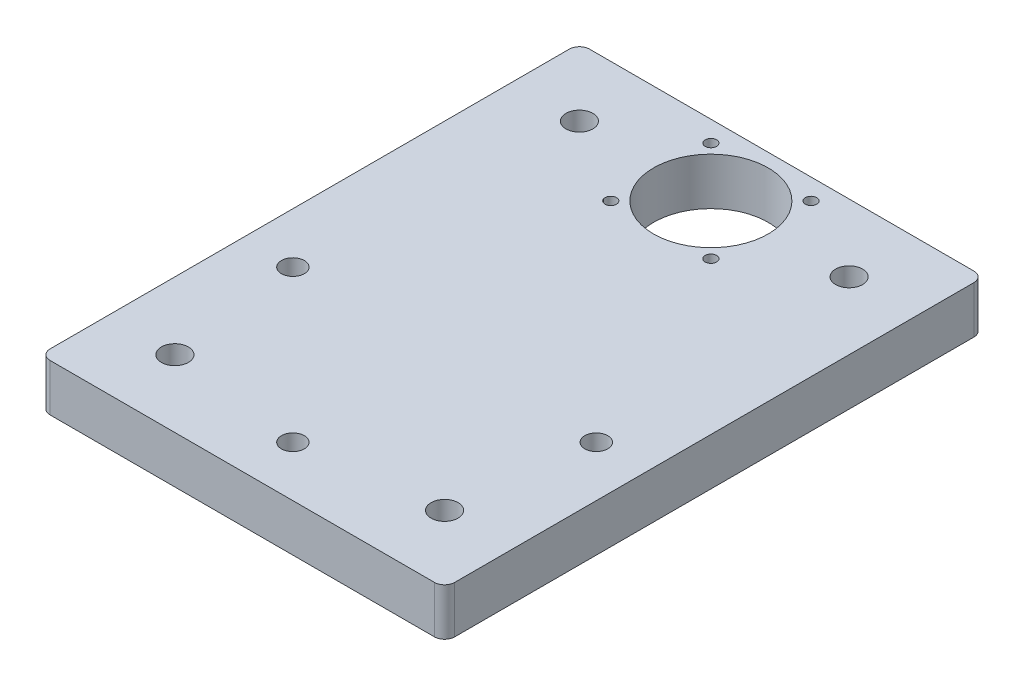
ISO-10303-21;
HEADER;
FILE_DESCRIPTION(('STEP AP214'),'2;1');
FILE_NAME('part.step','',(''),(''),'','','');
FILE_SCHEMA(('AUTOMOTIVE_DESIGN { 1 0 10303 214 1 1 1 1 }'));
ENDSEC;
DATA;
#1=APPLICATION_CONTEXT('core data for automotive mechanical design processes');
#2=APPLICATION_PROTOCOL_DEFINITION('international standard','automotive_design',2000,#1);
#3=PRODUCT_CONTEXT('',#1,'mechanical');
#4=PRODUCT('Part','Part','',(#3));
#5=PRODUCT_RELATED_PRODUCT_CATEGORY('part','',(#4));
#6=PRODUCT_DEFINITION_FORMATION('','',#4);
#7=PRODUCT_DEFINITION_CONTEXT('part definition',#1,'design');
#8=PRODUCT_DEFINITION('design','',#6,#7);
#9=PRODUCT_DEFINITION_SHAPE('','',#8);
#10=(LENGTH_UNIT() NAMED_UNIT(*) SI_UNIT(.MILLI.,.METRE.));
#11=(NAMED_UNIT(*) PLANE_ANGLE_UNIT() SI_UNIT($,.RADIAN.));
#12=(NAMED_UNIT(*) SI_UNIT($,.STERADIAN.) SOLID_ANGLE_UNIT());
#13=UNCERTAINTY_MEASURE_WITH_UNIT(LENGTH_MEASURE(1.E-05),#10,'distance_accuracy_value','');
#14=(GEOMETRIC_REPRESENTATION_CONTEXT(3) GLOBAL_UNCERTAINTY_ASSIGNED_CONTEXT((#13)) GLOBAL_UNIT_ASSIGNED_CONTEXT((#10,
#11,#12)) REPRESENTATION_CONTEXT('',''));
#15=CARTESIAN_POINT('',(0.,0.,0.));
#16=DIRECTION('',(0.,0.,1.));
#17=DIRECTION('',(1.,0.,0.));
#18=AXIS2_PLACEMENT_3D('',#15,#16,#17);
#19=CARTESIAN_POINT('',(-57.,14.,97.));
#20=DIRECTION('',(0.,-1.,0.));
#21=DIRECTION('',(0.,0.,-1.));
#22=AXIS2_PLACEMENT_3D('',#19,#20,#21);
#23=CYLINDRICAL_SURFACE('',#22,3.);
#24=CARTESIAN_POINT('',(-57.,0.,97.));
#25=DIRECTION('',(0.,1.,0.));
#26=DIRECTION('',(0.,0.,-1.));
#27=AXIS2_PLACEMENT_3D('',#24,#25,#26);
#28=CIRCLE('',#27,3.);
#29=CARTESIAN_POINT('',(-60.,0.,97.));
#30=VERTEX_POINT('',#29);
#31=CARTESIAN_POINT('',(-57.,0.,100.));
#32=VERTEX_POINT('',#31);
#33=EDGE_CURVE('E138',#30,#32,#28,.T.);
#34=ORIENTED_EDGE('',*,*,#33,.T.);
#35=DIRECTION('',(0.,-1.,0.));
#36=VECTOR('',#35,1.);
#37=CARTESIAN_POINT('',(-57.,14.,100.));
#38=LINE('',#37,#36);
#39=CARTESIAN_POINT('',(-57.,14.,100.));
#40=VERTEX_POINT('',#39);
#41=EDGE_CURVE('E11',#40,#32,#38,.T.);
#42=ORIENTED_EDGE('',*,*,#41,.F.);
#43=CARTESIAN_POINT('',(-57.,14.,97.));
#44=DIRECTION('',(0.,1.,0.));
#45=DIRECTION('',(0.,0.,-1.));
#46=AXIS2_PLACEMENT_3D('',#43,#44,#45);
#47=CIRCLE('',#46,3.);
#48=CARTESIAN_POINT('',(-60.,14.,97.));
#49=VERTEX_POINT('',#48);
#50=EDGE_CURVE('E152',#49,#40,#47,.T.);
#51=ORIENTED_EDGE('',*,*,#50,.F.);
#52=DIRECTION('',(0.,-1.,0.));
#53=VECTOR('',#52,1.);
#54=CARTESIAN_POINT('',(-60.,14.,97.));
#55=LINE('',#54,#53);
#56=EDGE_CURVE('E134',#49,#30,#55,.T.);
#57=ORIENTED_EDGE('',*,*,#56,.T.);
#58=EDGE_LOOP('',(#34,#42,#51,#57));
#59=FACE_BOUND('',#58,.T.);
#60=ADVANCED_FACE('F43',(#59),#23,.T.);
#61=CARTESIAN_POINT('',(-57.,14.,100.));
#62=DIRECTION('',(0.,0.,-1.));
#63=DIRECTION('',(-1.,0.,0.));
#64=AXIS2_PLACEMENT_3D('',#61,#62,#63);
#65=PLANE('',#64);
#66=DIRECTION('',(1.,0.,0.));
#67=VECTOR('',#66,1.);
#68=CARTESIAN_POINT('',(-57.,0.,100.));
#69=LINE('',#68,#67);
#70=CARTESIAN_POINT('',(57.,0.,100.));
#71=VERTEX_POINT('',#70);
#72=EDGE_CURVE('E145',#32,#71,#69,.T.);
#73=ORIENTED_EDGE('',*,*,#72,.T.);
#74=DIRECTION('',(0.,-1.,0.));
#75=VECTOR('',#74,1.);
#76=CARTESIAN_POINT('',(57.,14.,100.));
#77=LINE('',#76,#75);
#78=CARTESIAN_POINT('',(57.,14.,100.));
#79=VERTEX_POINT('',#78);
#80=EDGE_CURVE('E51',#79,#71,#77,.T.);
#81=ORIENTED_EDGE('',*,*,#80,.F.);
#82=DIRECTION('',(1.,0.,0.));
#83=VECTOR('',#82,1.);
#84=CARTESIAN_POINT('',(-57.,14.,100.));
#85=LINE('',#84,#83);
#86=EDGE_CURVE('E105',#40,#79,#85,.T.);
#87=ORIENTED_EDGE('',*,*,#86,.F.);
#88=ORIENTED_EDGE('',*,*,#41,.T.);
#89=EDGE_LOOP('',(#73,#81,#87,#88));
#90=FACE_BOUND('',#89,.T.);
#91=ADVANCED_FACE('F299',(#90),#65,.F.);
#92=CARTESIAN_POINT('',(57.,14.,97.));
#93=DIRECTION('',(0.,-1.,0.));
#94=DIRECTION('',(0.,0.,-1.));
#95=AXIS2_PLACEMENT_3D('',#92,#93,#94);
#96=CYLINDRICAL_SURFACE('',#95,3.);
#97=CARTESIAN_POINT('',(57.,0.,97.));
#98=DIRECTION('',(0.,1.,0.));
#99=DIRECTION('',(0.,0.,1.));
#100=AXIS2_PLACEMENT_3D('',#97,#98,#99);
#101=CIRCLE('',#100,3.);
#102=CARTESIAN_POINT('',(60.,0.,97.));
#103=VERTEX_POINT('',#102);
#104=EDGE_CURVE('E143',#71,#103,#101,.T.);
#105=ORIENTED_EDGE('',*,*,#104,.T.);
#106=DIRECTION('',(0.,-1.,0.));
#107=VECTOR('',#106,1.);
#108=CARTESIAN_POINT('',(60.,14.,97.));
#109=LINE('',#108,#107);
#110=CARTESIAN_POINT('',(60.,14.,97.));
#111=VERTEX_POINT('',#110);
#112=EDGE_CURVE('E163',#111,#103,#109,.T.);
#113=ORIENTED_EDGE('',*,*,#112,.F.);
#114=CARTESIAN_POINT('',(57.,14.,97.));
#115=DIRECTION('',(0.,1.,0.));
#116=DIRECTION('',(0.,0.,1.));
#117=AXIS2_PLACEMENT_3D('',#114,#115,#116);
#118=CIRCLE('',#117,3.);
#119=EDGE_CURVE('E169',#79,#111,#118,.T.);
#120=ORIENTED_EDGE('',*,*,#119,.F.);
#121=ORIENTED_EDGE('',*,*,#80,.T.);
#122=EDGE_LOOP('',(#105,#113,#120,#121));
#123=FACE_BOUND('',#122,.T.);
#124=ADVANCED_FACE('F170',(#123),#96,.T.);
#125=CARTESIAN_POINT('',(60.,14.,97.));
#126=DIRECTION('',(-1.,0.,0.));
#127=DIRECTION('',(0.,0.,1.));
#128=AXIS2_PLACEMENT_3D('',#125,#126,#127);
#129=PLANE('',#128);
#130=DIRECTION('',(0.,0.,-1.));
#131=VECTOR('',#130,1.);
#132=CARTESIAN_POINT('',(60.,0.,97.));
#133=LINE('',#132,#131);
#134=CARTESIAN_POINT('',(60.,0.,-57.));
#135=VERTEX_POINT('',#134);
#136=EDGE_CURVE('E150',#103,#135,#133,.T.);
#137=ORIENTED_EDGE('',*,*,#136,.T.);
#138=DIRECTION('',(0.,-1.,0.));
#139=VECTOR('',#138,1.);
#140=CARTESIAN_POINT('',(60.,14.,-57.));
#141=LINE('',#140,#139);
#142=CARTESIAN_POINT('',(60.,14.,-57.));
#143=VERTEX_POINT('',#142);
#144=EDGE_CURVE('E160',#143,#135,#141,.T.);
#145=ORIENTED_EDGE('',*,*,#144,.F.);
#146=DIRECTION('',(0.,0.,-1.));
#147=VECTOR('',#146,1.);
#148=CARTESIAN_POINT('',(60.,14.,97.));
#149=LINE('',#148,#147);
#150=EDGE_CURVE('E181',#111,#143,#149,.T.);
#151=ORIENTED_EDGE('',*,*,#150,.F.);
#152=ORIENTED_EDGE('',*,*,#112,.T.);
#153=EDGE_LOOP('',(#137,#145,#151,#152));
#154=FACE_BOUND('',#153,.T.);
#155=ADVANCED_FACE('F180',(#154),#129,.F.);
#156=CARTESIAN_POINT('',(57.,14.,-57.));
#157=DIRECTION('',(0.,-1.,0.));
#158=DIRECTION('',(0.,0.,-1.));
#159=AXIS2_PLACEMENT_3D('',#156,#157,#158);
#160=CYLINDRICAL_SURFACE('',#159,3.);
#161=CARTESIAN_POINT('',(57.,0.,-57.));
#162=DIRECTION('',(0.,1.,0.));
#163=DIRECTION('',(0.,0.,-1.));
#164=AXIS2_PLACEMENT_3D('',#161,#162,#163);
#165=CIRCLE('',#164,3.);
#166=CARTESIAN_POINT('',(57.,0.,-60.));
#167=VERTEX_POINT('',#166);
#168=EDGE_CURVE('E148',#135,#167,#165,.T.);
#169=ORIENTED_EDGE('',*,*,#168,.T.);
#170=DIRECTION('',(0.,-1.,0.));
#171=VECTOR('',#170,1.);
#172=CARTESIAN_POINT('',(57.,14.,-60.));
#173=LINE('',#172,#171);
#174=CARTESIAN_POINT('',(57.,14.,-60.));
#175=VERTEX_POINT('',#174);
#176=EDGE_CURVE('E129',#175,#167,#173,.T.);
#177=ORIENTED_EDGE('',*,*,#176,.F.);
#178=CARTESIAN_POINT('',(57.,14.,-57.));
#179=DIRECTION('',(0.,1.,0.));
#180=DIRECTION('',(0.,0.,-1.));
#181=AXIS2_PLACEMENT_3D('',#178,#179,#180);
#182=CIRCLE('',#181,3.);
#183=EDGE_CURVE('E122',#143,#175,#182,.T.);
#184=ORIENTED_EDGE('',*,*,#183,.F.);
#185=ORIENTED_EDGE('',*,*,#144,.T.);
#186=EDGE_LOOP('',(#169,#177,#184,#185));
#187=FACE_BOUND('',#186,.T.);
#188=ADVANCED_FACE('F179',(#187),#160,.T.);
#189=CARTESIAN_POINT('',(-57.,14.,-60.));
#190=DIRECTION('',(0.,0.,1.));
#191=DIRECTION('',(1.,0.,0.));
#192=AXIS2_PLACEMENT_3D('',#189,#190,#191);
#193=PLANE('',#192);
#194=DIRECTION('',(-1.,0.,0.));
#195=VECTOR('',#194,1.);
#196=CARTESIAN_POINT('',(-57.,0.,-60.));
#197=LINE('',#196,#195);
#198=CARTESIAN_POINT('',(-57.,0.,-60.));
#199=VERTEX_POINT('',#198);
#200=EDGE_CURVE('E128',#167,#199,#197,.T.);
#201=ORIENTED_EDGE('',*,*,#200,.T.);
#202=DIRECTION('',(0.,-1.,0.));
#203=VECTOR('',#202,1.);
#204=CARTESIAN_POINT('',(-57.,14.,-60.));
#205=LINE('',#204,#203);
#206=CARTESIAN_POINT('',(-57.,14.,-60.));
#207=VERTEX_POINT('',#206);
#208=EDGE_CURVE('E126',#207,#199,#205,.T.);
#209=ORIENTED_EDGE('',*,*,#208,.F.);
#210=DIRECTION('',(-1.,0.,0.));
#211=VECTOR('',#210,1.);
#212=CARTESIAN_POINT('',(-57.,14.,-60.));
#213=LINE('',#212,#211);
#214=EDGE_CURVE('E114',#175,#207,#213,.T.);
#215=ORIENTED_EDGE('',*,*,#214,.F.);
#216=ORIENTED_EDGE('',*,*,#176,.T.);
#217=EDGE_LOOP('',(#201,#209,#215,#216));
#218=FACE_BOUND('',#217,.T.);
#219=ADVANCED_FACE('F130',(#218),#193,.F.);
#220=CARTESIAN_POINT('',(-57.,14.,-57.));
#221=DIRECTION('',(0.,-1.,0.));
#222=DIRECTION('',(0.,0.,-1.));
#223=AXIS2_PLACEMENT_3D('',#220,#221,#222);
#224=CYLINDRICAL_SURFACE('',#223,3.);
#225=CARTESIAN_POINT('',(-57.,0.,-57.));
#226=DIRECTION('',(0.,1.,0.));
#227=DIRECTION('',(0.,0.,-1.));
#228=AXIS2_PLACEMENT_3D('',#225,#226,#227);
#229=CIRCLE('',#228,3.);
#230=CARTESIAN_POINT('',(-60.,0.,-57.));
#231=VERTEX_POINT('',#230);
#232=EDGE_CURVE('E88',#199,#231,#229,.T.);
#233=ORIENTED_EDGE('',*,*,#232,.T.);
#234=DIRECTION('',(0.,-1.,0.));
#235=VECTOR('',#234,1.);
#236=CARTESIAN_POINT('',(-60.,14.,-57.));
#237=LINE('',#236,#235);
#238=CARTESIAN_POINT('',(-60.,14.,-57.));
#239=VERTEX_POINT('',#238);
#240=EDGE_CURVE('E131',#239,#231,#237,.T.);
#241=ORIENTED_EDGE('',*,*,#240,.F.);
#242=CARTESIAN_POINT('',(-57.,14.,-57.));
#243=DIRECTION('',(0.,1.,0.));
#244=DIRECTION('',(0.,0.,-1.));
#245=AXIS2_PLACEMENT_3D('',#242,#243,#244);
#246=CIRCLE('',#245,3.);
#247=EDGE_CURVE('E118',#207,#239,#246,.T.);
#248=ORIENTED_EDGE('',*,*,#247,.F.);
#249=ORIENTED_EDGE('',*,*,#208,.T.);
#250=EDGE_LOOP('',(#233,#241,#248,#249));
#251=FACE_BOUND('',#250,.T.);
#252=ADVANCED_FACE('F133',(#251),#224,.T.);
#253=CARTESIAN_POINT('',(-60.,14.,97.));
#254=DIRECTION('',(1.,0.,0.));
#255=DIRECTION('',(0.,0.,-1.));
#256=AXIS2_PLACEMENT_3D('',#253,#254,#255);
#257=PLANE('',#256);
#258=DIRECTION('',(0.,0.,1.));
#259=VECTOR('',#258,1.);
#260=CARTESIAN_POINT('',(-60.,0.,97.));
#261=LINE('',#260,#259);
#262=EDGE_CURVE('E93',#231,#30,#261,.T.);
#263=ORIENTED_EDGE('',*,*,#262,.T.);
#264=ORIENTED_EDGE('',*,*,#56,.F.);
#265=DIRECTION('',(0.,0.,1.));
#266=VECTOR('',#265,1.);
#267=CARTESIAN_POINT('',(-60.,14.,97.));
#268=LINE('',#267,#266);
#269=EDGE_CURVE('E56',#239,#49,#268,.T.);
#270=ORIENTED_EDGE('',*,*,#269,.F.);
#271=ORIENTED_EDGE('',*,*,#240,.T.);
#272=EDGE_LOOP('',(#263,#264,#270,#271));
#273=FACE_BOUND('',#272,.T.);
#274=ADVANCED_FACE('F306',(#273),#257,.F.);
#275=CARTESIAN_POINT('',(-57.,14.,97.));
#276=DIRECTION('',(0.,-1.,0.));
#277=DIRECTION('',(0.,0.,-1.));
#278=AXIS2_PLACEMENT_3D('',#275,#276,#277);
#279=PLANE('',#278);
#280=CARTESIAN_POINT('',(-40.,14.,80.));
#281=DIRECTION('',(0.,-1.,0.));
#282=DIRECTION('',(0.,0.,1.));
#283=AXIS2_PLACEMENT_3D('',#280,#281,#282);
#284=CIRCLE('',#283,4.00000000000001);
#285=CARTESIAN_POINT('',(-40.,14.,84.));
#286=VERTEX_POINT('',#285);
#287=EDGE_CURVE('E247',#286,#286,#284,.T.);
#288=ORIENTED_EDGE('',*,*,#287,.T.);
#289=EDGE_LOOP('',(#288));
#290=FACE_BOUND('',#289,.T.);
#291=CARTESIAN_POINT('',(40.,14.,-39.9999999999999));
#292=DIRECTION('',(0.,-1.,0.));
#293=DIRECTION('',(0.,0.,1.));
#294=AXIS2_PLACEMENT_3D('',#291,#292,#293);
#295=CIRCLE('',#294,4.00000000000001);
#296=CARTESIAN_POINT('',(40.,14.,-35.9999999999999));
#297=VERTEX_POINT('',#296);
#298=EDGE_CURVE('E241',#297,#297,#295,.T.);
#299=ORIENTED_EDGE('',*,*,#298,.T.);
#300=EDGE_LOOP('',(#299));
#301=FACE_BOUND('',#300,.T.);
#302=CARTESIAN_POINT('',(-39.9999999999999,14.,-40.));
#303=DIRECTION('',(0.,-1.,0.));
#304=DIRECTION('',(0.,0.,-1.));
#305=AXIS2_PLACEMENT_3D('',#302,#303,#304);
#306=CIRCLE('',#305,4.00000000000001);
#307=CARTESIAN_POINT('',(-39.9999999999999,14.,-44.));
#308=VERTEX_POINT('',#307);
#309=EDGE_CURVE('E254',#308,#308,#306,.T.);
#310=ORIENTED_EDGE('',*,*,#309,.T.);
#311=EDGE_LOOP('',(#310));
#312=FACE_BOUND('',#311,.T.);
#313=CARTESIAN_POINT('',(40.,14.,80.));
#314=DIRECTION('',(0.,-1.,0.));
#315=DIRECTION('',(0.,0.,-1.));
#316=AXIS2_PLACEMENT_3D('',#313,#314,#315);
#317=CIRCLE('',#316,4.00000000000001);
#318=CARTESIAN_POINT('',(40.,14.,76.));
#319=VERTEX_POINT('',#318);
#320=EDGE_CURVE('E235',#319,#319,#317,.T.);
#321=ORIENTED_EDGE('',*,*,#320,.T.);
#322=EDGE_LOOP('',(#321));
#323=FACE_BOUND('',#322,.T.);
#324=CARTESIAN_POINT('',(4.0628570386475E-09,14.,-38.9999999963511));
#325=DIRECTION('',(0.,1.,0.));
#326=DIRECTION('',(0.,0.,1.));
#327=AXIS2_PLACEMENT_3D('',#324,#325,#326);
#328=CIRCLE('',#327,16.999999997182);
#329=CARTESIAN_POINT('',(4.0628570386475E-09,14.,-21.9999999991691));
#330=VERTEX_POINT('',#329);
#331=EDGE_CURVE('E230',#330,#330,#328,.T.);
#332=ORIENTED_EDGE('',*,*,#331,.F.);
#333=EDGE_LOOP('',(#332));
#334=FACE_BOUND('',#333,.T.);
#335=CARTESIAN_POINT('',(2.35055030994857E-13,14.,85.));
#336=DIRECTION('',(0.,-1.,0.));
#337=DIRECTION('',(0.,0.,-1.));
#338=AXIS2_PLACEMENT_3D('',#335,#336,#337);
#339=CIRCLE('',#338,3.4);
#340=CARTESIAN_POINT('',(2.35055030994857E-13,14.,81.6));
#341=VERTEX_POINT('',#340);
#342=EDGE_CURVE('E200',#341,#341,#339,.T.);
#343=ORIENTED_EDGE('',*,*,#342,.T.);
#344=EDGE_LOOP('',(#343));
#345=FACE_BOUND('',#344,.T.);
#346=CARTESIAN_POINT('',(45.,14.,40.));
#347=DIRECTION('',(0.,-1.,0.));
#348=DIRECTION('',(0.,0.,-1.));
#349=AXIS2_PLACEMENT_3D('',#346,#347,#348);
#350=CIRCLE('',#349,3.4);
#351=CARTESIAN_POINT('',(45.,14.,36.6));
#352=VERTEX_POINT('',#351);
#353=EDGE_CURVE('E218',#352,#352,#350,.T.);
#354=ORIENTED_EDGE('',*,*,#353,.T.);
#355=EDGE_LOOP('',(#354));
#356=FACE_BOUND('',#355,.T.);
#357=CARTESIAN_POINT('',(-45.,14.,40.));
#358=DIRECTION('',(0.,-1.,0.));
#359=DIRECTION('',(0.,0.,-1.));
#360=AXIS2_PLACEMENT_3D('',#357,#358,#359);
#361=CIRCLE('',#360,3.4);
#362=CARTESIAN_POINT('',(-45.,14.,36.6));
#363=VERTEX_POINT('',#362);
#364=EDGE_CURVE('E211',#363,#363,#361,.T.);
#365=ORIENTED_EDGE('',*,*,#364,.T.);
#366=EDGE_LOOP('',(#365));
#367=FACE_BOUND('',#366,.T.);
#368=CARTESIAN_POINT('',(-14.8492424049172,14.,-24.1507575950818));
#369=DIRECTION('',(0.,-1.,0.));
#370=DIRECTION('',(0.,0.,-1.));
#371=AXIS2_PLACEMENT_3D('',#368,#369,#370);
#372=CIRCLE('',#371,1.7);
#373=CARTESIAN_POINT('',(-14.8492424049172,14.,-25.8507575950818));
#374=VERTEX_POINT('',#373);
#375=EDGE_CURVE('E192',#374,#374,#372,.T.);
#376=ORIENTED_EDGE('',*,*,#375,.T.);
#377=EDGE_LOOP('',(#376));
#378=FACE_BOUND('',#377,.T.);
#379=CARTESIAN_POINT('',(-14.8492424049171,14.,-53.8492424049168));
#380=DIRECTION('',(0.,-1.,0.));
#381=DIRECTION('',(0.,0.,-1.));
#382=AXIS2_PLACEMENT_3D('',#379,#380,#381);
#383=CIRCLE('',#382,1.7);
#384=CARTESIAN_POINT('',(-14.8492424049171,14.,-55.5492424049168));
#385=VERTEX_POINT('',#384);
#386=EDGE_CURVE('E199',#385,#385,#383,.T.);
#387=ORIENTED_EDGE('',*,*,#386,.T.);
#388=EDGE_LOOP('',(#387));
#389=FACE_BOUND('',#388,.T.);
#390=CARTESIAN_POINT('',(14.849242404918,14.,-53.8492424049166));
#391=DIRECTION('',(0.,-1.,0.));
#392=DIRECTION('',(0.,0.,-1.));
#393=AXIS2_PLACEMENT_3D('',#390,#391,#392);
#394=CIRCLE('',#393,1.7);
#395=CARTESIAN_POINT('',(14.849242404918,14.,-55.5492424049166));
#396=VERTEX_POINT('',#395);
#397=EDGE_CURVE('E207',#396,#396,#394,.T.);
#398=ORIENTED_EDGE('',*,*,#397,.T.);
#399=EDGE_LOOP('',(#398));
#400=FACE_BOUND('',#399,.T.);
#401=CARTESIAN_POINT('',(14.8492424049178,14.,-24.1507575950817));
#402=DIRECTION('',(0.,-1.,0.));
#403=DIRECTION('',(0.,0.,-1.));
#404=AXIS2_PLACEMENT_3D('',#401,#402,#403);
#405=CIRCLE('',#404,1.7);
#406=CARTESIAN_POINT('',(14.8492424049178,14.,-25.8507575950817));
#407=VERTEX_POINT('',#406);
#408=EDGE_CURVE('E141',#407,#407,#405,.T.);
#409=ORIENTED_EDGE('',*,*,#408,.T.);
#410=EDGE_LOOP('',(#409));
#411=FACE_BOUND('',#410,.T.);
#412=ORIENTED_EDGE('',*,*,#50,.T.);
#413=ORIENTED_EDGE('',*,*,#86,.T.);
#414=ORIENTED_EDGE('',*,*,#119,.T.);
#415=ORIENTED_EDGE('',*,*,#150,.T.);
#416=ORIENTED_EDGE('',*,*,#183,.T.);
#417=ORIENTED_EDGE('',*,*,#214,.T.);
#418=ORIENTED_EDGE('',*,*,#247,.T.);
#419=ORIENTED_EDGE('',*,*,#269,.T.);
#420=EDGE_LOOP('',(#412,#413,#414,#415,#416,#417,#418,#419));
#421=FACE_BOUND('',#420,.T.);
#422=ADVANCED_FACE('F120',(#290,#301,#312,#323,#334,#345,#356,#367,#378,#389,#400,#411,#421),
#279,.F.);
#423=CARTESIAN_POINT('',(-57.,0.,97.));
#424=DIRECTION('',(0.,-1.,0.));
#425=DIRECTION('',(0.,0.,-1.));
#426=AXIS2_PLACEMENT_3D('',#423,#424,#425);
#427=PLANE('',#426);
#428=CARTESIAN_POINT('',(-40.,0.,80.));
#429=DIRECTION('',(0.,-1.,0.));
#430=DIRECTION('',(0.,0.,1.));
#431=AXIS2_PLACEMENT_3D('',#428,#429,#430);
#432=CIRCLE('',#431,4.00000000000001);
#433=CARTESIAN_POINT('',(-40.,0.,84.));
#434=VERTEX_POINT('',#433);
#435=EDGE_CURVE('E238',#434,#434,#432,.T.);
#436=ORIENTED_EDGE('',*,*,#435,.F.);
#437=EDGE_LOOP('',(#436));
#438=FACE_BOUND('',#437,.T.);
#439=CARTESIAN_POINT('',(40.,0.,-39.9999999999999));
#440=DIRECTION('',(0.,-1.,0.));
#441=DIRECTION('',(0.,0.,1.));
#442=AXIS2_PLACEMENT_3D('',#439,#440,#441);
#443=CIRCLE('',#442,4.00000000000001);
#444=CARTESIAN_POINT('',(40.,0.,-35.9999999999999));
#445=VERTEX_POINT('',#444);
#446=EDGE_CURVE('E242',#445,#445,#443,.T.);
#447=ORIENTED_EDGE('',*,*,#446,.F.);
#448=EDGE_LOOP('',(#447));
#449=FACE_BOUND('',#448,.T.);
#450=CARTESIAN_POINT('',(-39.9999999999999,0.,-40.));
#451=DIRECTION('',(0.,-1.,0.));
#452=DIRECTION('',(0.,0.,-1.));
#453=AXIS2_PLACEMENT_3D('',#450,#451,#452);
#454=CIRCLE('',#453,4.00000000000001);
#455=CARTESIAN_POINT('',(-39.9999999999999,0.,-44.));
#456=VERTEX_POINT('',#455);
#457=EDGE_CURVE('E244',#456,#456,#454,.T.);
#458=ORIENTED_EDGE('',*,*,#457,.F.);
#459=EDGE_LOOP('',(#458));
#460=FACE_BOUND('',#459,.T.);
#461=CARTESIAN_POINT('',(40.,0.,80.));
#462=DIRECTION('',(0.,-1.,0.));
#463=DIRECTION('',(0.,0.,-1.));
#464=AXIS2_PLACEMENT_3D('',#461,#462,#463);
#465=CIRCLE('',#464,4.00000000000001);
#466=CARTESIAN_POINT('',(40.,0.,76.));
#467=VERTEX_POINT('',#466);
#468=EDGE_CURVE('E232',#467,#467,#465,.T.);
#469=ORIENTED_EDGE('',*,*,#468,.F.);
#470=EDGE_LOOP('',(#469));
#471=FACE_BOUND('',#470,.T.);
#472=CARTESIAN_POINT('',(4.0628570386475E-09,0.,-38.9999999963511));
#473=DIRECTION('',(0.,1.,0.));
#474=DIRECTION('',(0.,0.,1.));
#475=AXIS2_PLACEMENT_3D('',#472,#473,#474);
#476=CIRCLE('',#475,16.999999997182);
#477=CARTESIAN_POINT('',(4.0628570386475E-09,0.,-21.9999999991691));
#478=VERTEX_POINT('',#477);
#479=EDGE_CURVE('E214',#478,#478,#476,.T.);
#480=ORIENTED_EDGE('',*,*,#479,.T.);
#481=EDGE_LOOP('',(#480));
#482=FACE_BOUND('',#481,.T.);
#483=CARTESIAN_POINT('',(2.35055030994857E-13,0.,85.));
#484=DIRECTION('',(0.,-1.,0.));
#485=DIRECTION('',(0.,0.,-1.));
#486=AXIS2_PLACEMENT_3D('',#483,#484,#485);
#487=CIRCLE('',#486,3.4);
#488=CARTESIAN_POINT('',(2.35055030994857E-13,0.,81.6));
#489=VERTEX_POINT('',#488);
#490=EDGE_CURVE('E223',#489,#489,#487,.T.);
#491=ORIENTED_EDGE('',*,*,#490,.F.);
#492=EDGE_LOOP('',(#491));
#493=FACE_BOUND('',#492,.T.);
#494=CARTESIAN_POINT('',(45.,0.,40.));
#495=DIRECTION('',(0.,-1.,0.));
#496=DIRECTION('',(0.,0.,-1.));
#497=AXIS2_PLACEMENT_3D('',#494,#495,#496);
#498=CIRCLE('',#497,3.4);
#499=CARTESIAN_POINT('',(45.,0.,36.6));
#500=VERTEX_POINT('',#499);
#501=EDGE_CURVE('E224',#500,#500,#498,.T.);
#502=ORIENTED_EDGE('',*,*,#501,.F.);
#503=EDGE_LOOP('',(#502));
#504=FACE_BOUND('',#503,.T.);
#505=CARTESIAN_POINT('',(-45.,0.,40.));
#506=DIRECTION('',(0.,-1.,0.));
#507=DIRECTION('',(0.,0.,-1.));
#508=AXIS2_PLACEMENT_3D('',#505,#506,#507);
#509=CIRCLE('',#508,3.4);
#510=CARTESIAN_POINT('',(-45.,0.,36.6));
#511=VERTEX_POINT('',#510);
#512=EDGE_CURVE('E213',#511,#511,#509,.T.);
#513=ORIENTED_EDGE('',*,*,#512,.F.);
#514=EDGE_LOOP('',(#513));
#515=FACE_BOUND('',#514,.T.);
#516=CARTESIAN_POINT('',(-14.8492424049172,0.,-24.1507575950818));
#517=DIRECTION('',(0.,-1.,0.));
#518=DIRECTION('',(0.,0.,-1.));
#519=AXIS2_PLACEMENT_3D('',#516,#517,#518);
#520=CIRCLE('',#519,1.7);
#521=CARTESIAN_POINT('',(-14.8492424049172,0.,-25.8507575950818));
#522=VERTEX_POINT('',#521);
#523=EDGE_CURVE('E196',#522,#522,#520,.T.);
#524=ORIENTED_EDGE('',*,*,#523,.F.);
#525=EDGE_LOOP('',(#524));
#526=FACE_BOUND('',#525,.T.);
#527=CARTESIAN_POINT('',(-14.8492424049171,0.,-53.8492424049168));
#528=DIRECTION('',(0.,-1.,0.));
#529=DIRECTION('',(0.,0.,-1.));
#530=AXIS2_PLACEMENT_3D('',#527,#528,#529);
#531=CIRCLE('',#530,1.7);
#532=CARTESIAN_POINT('',(-14.8492424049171,0.,-55.5492424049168));
#533=VERTEX_POINT('',#532);
#534=EDGE_CURVE('E205',#533,#533,#531,.T.);
#535=ORIENTED_EDGE('',*,*,#534,.F.);
#536=EDGE_LOOP('',(#535));
#537=FACE_BOUND('',#536,.T.);
#538=CARTESIAN_POINT('',(14.849242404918,0.,-53.8492424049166));
#539=DIRECTION('',(0.,-1.,0.));
#540=DIRECTION('',(0.,0.,-1.));
#541=AXIS2_PLACEMENT_3D('',#538,#539,#540);
#542=CIRCLE('',#541,1.7);
#543=CARTESIAN_POINT('',(14.849242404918,0.,-55.5492424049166));
#544=VERTEX_POINT('',#543);
#545=EDGE_CURVE('E188',#544,#544,#542,.T.);
#546=ORIENTED_EDGE('',*,*,#545,.F.);
#547=EDGE_LOOP('',(#546));
#548=FACE_BOUND('',#547,.T.);
#549=CARTESIAN_POINT('',(14.8492424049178,0.,-24.1507575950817));
#550=DIRECTION('',(0.,-1.,0.));
#551=DIRECTION('',(0.,0.,-1.));
#552=AXIS2_PLACEMENT_3D('',#549,#550,#551);
#553=CIRCLE('',#552,1.7);
#554=CARTESIAN_POINT('',(14.8492424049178,0.,-25.8507575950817));
#555=VERTEX_POINT('',#554);
#556=EDGE_CURVE('E190',#555,#555,#553,.T.);
#557=ORIENTED_EDGE('',*,*,#556,.F.);
#558=EDGE_LOOP('',(#557));
#559=FACE_BOUND('',#558,.T.);
#560=ORIENTED_EDGE('',*,*,#33,.F.);
#561=ORIENTED_EDGE('',*,*,#262,.F.);
#562=ORIENTED_EDGE('',*,*,#232,.F.);
#563=ORIENTED_EDGE('',*,*,#200,.F.);
#564=ORIENTED_EDGE('',*,*,#168,.F.);
#565=ORIENTED_EDGE('',*,*,#136,.F.);
#566=ORIENTED_EDGE('',*,*,#104,.F.);
#567=ORIENTED_EDGE('',*,*,#72,.F.);
#568=EDGE_LOOP('',(#560,#561,#562,#563,#564,#565,#566,#567));
#569=FACE_BOUND('',#568,.T.);
#570=ADVANCED_FACE('F173',(#438,#449,#460,#471,#482,#493,#504,#515,#526,#537,#548,#559,#569),
#427,.T.);
#571=CARTESIAN_POINT('',(14.8492424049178,14.,-24.1507575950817));
#572=DIRECTION('',(0.,-1.,0.));
#573=DIRECTION('',(0.,0.,-1.));
#574=AXIS2_PLACEMENT_3D('',#571,#572,#573);
#575=CYLINDRICAL_SURFACE('',#574,1.7);
#576=ORIENTED_EDGE('',*,*,#408,.F.);
#577=EDGE_LOOP('',(#576));
#578=FACE_BOUND('',#577,.T.);
#579=ORIENTED_EDGE('',*,*,#556,.T.);
#580=EDGE_LOOP('',(#579));
#581=FACE_BOUND('',#580,.T.);
#582=ADVANCED_FACE('F263',(#578,#581),#575,.F.);
#583=CARTESIAN_POINT('',(14.849242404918,14.,-53.8492424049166));
#584=DIRECTION('',(0.,-1.,0.));
#585=DIRECTION('',(0.,0.,-1.));
#586=AXIS2_PLACEMENT_3D('',#583,#584,#585);
#587=CYLINDRICAL_SURFACE('',#586,1.7);
#588=ORIENTED_EDGE('',*,*,#397,.F.);
#589=EDGE_LOOP('',(#588));
#590=FACE_BOUND('',#589,.T.);
#591=ORIENTED_EDGE('',*,*,#545,.T.);
#592=EDGE_LOOP('',(#591));
#593=FACE_BOUND('',#592,.T.);
#594=ADVANCED_FACE('F284',(#590,#593),#587,.F.);
#595=CARTESIAN_POINT('',(-14.8492424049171,14.,-53.8492424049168));
#596=DIRECTION('',(0.,-1.,0.));
#597=DIRECTION('',(0.,0.,-1.));
#598=AXIS2_PLACEMENT_3D('',#595,#596,#597);
#599=CYLINDRICAL_SURFACE('',#598,1.7);
#600=ORIENTED_EDGE('',*,*,#386,.F.);
#601=EDGE_LOOP('',(#600));
#602=FACE_BOUND('',#601,.T.);
#603=ORIENTED_EDGE('',*,*,#534,.T.);
#604=EDGE_LOOP('',(#603));
#605=FACE_BOUND('',#604,.T.);
#606=ADVANCED_FACE('F292',(#602,#605),#599,.F.);
#607=CARTESIAN_POINT('',(-14.8492424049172,14.,-24.1507575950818));
#608=DIRECTION('',(0.,-1.,0.));
#609=DIRECTION('',(0.,0.,-1.));
#610=AXIS2_PLACEMENT_3D('',#607,#608,#609);
#611=CYLINDRICAL_SURFACE('',#610,1.7);
#612=ORIENTED_EDGE('',*,*,#375,.F.);
#613=EDGE_LOOP('',(#612));
#614=FACE_BOUND('',#613,.T.);
#615=ORIENTED_EDGE('',*,*,#523,.T.);
#616=EDGE_LOOP('',(#615));
#617=FACE_BOUND('',#616,.T.);
#618=ADVANCED_FACE('F388',(#614,#617),#611,.F.);
#619=CARTESIAN_POINT('',(-45.,14.,40.));
#620=DIRECTION('',(0.,-1.,0.));
#621=DIRECTION('',(0.,0.,-1.));
#622=AXIS2_PLACEMENT_3D('',#619,#620,#621);
#623=CYLINDRICAL_SURFACE('',#622,3.4);
#624=ORIENTED_EDGE('',*,*,#364,.F.);
#625=EDGE_LOOP('',(#624));
#626=FACE_BOUND('',#625,.T.);
#627=ORIENTED_EDGE('',*,*,#512,.T.);
#628=EDGE_LOOP('',(#627));
#629=FACE_BOUND('',#628,.T.);
#630=ADVANCED_FACE('F397',(#626,#629),#623,.F.);
#631=CARTESIAN_POINT('',(45.,14.,40.));
#632=DIRECTION('',(0.,-1.,0.));
#633=DIRECTION('',(0.,0.,-1.));
#634=AXIS2_PLACEMENT_3D('',#631,#632,#633);
#635=CYLINDRICAL_SURFACE('',#634,3.4);
#636=ORIENTED_EDGE('',*,*,#353,.F.);
#637=EDGE_LOOP('',(#636));
#638=FACE_BOUND('',#637,.T.);
#639=ORIENTED_EDGE('',*,*,#501,.T.);
#640=EDGE_LOOP('',(#639));
#641=FACE_BOUND('',#640,.T.);
#642=ADVANCED_FACE('F409',(#638,#641),#635,.F.);
#643=CARTESIAN_POINT('',(2.35055030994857E-13,14.,85.));
#644=DIRECTION('',(0.,-1.,0.));
#645=DIRECTION('',(0.,0.,-1.));
#646=AXIS2_PLACEMENT_3D('',#643,#644,#645);
#647=CYLINDRICAL_SURFACE('',#646,3.4);
#648=ORIENTED_EDGE('',*,*,#342,.F.);
#649=EDGE_LOOP('',(#648));
#650=FACE_BOUND('',#649,.T.);
#651=ORIENTED_EDGE('',*,*,#490,.T.);
#652=EDGE_LOOP('',(#651));
#653=FACE_BOUND('',#652,.T.);
#654=ADVANCED_FACE('F423',(#650,#653),#647,.F.);
#655=CARTESIAN_POINT('',(4.0628570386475E-09,0.,-38.9999999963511));
#656=DIRECTION('',(0.,1.,0.));
#657=DIRECTION('',(0.,0.,1.));
#658=AXIS2_PLACEMENT_3D('',#655,#656,#657);
#659=CYLINDRICAL_SURFACE('',#658,16.999999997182);
#660=ORIENTED_EDGE('',*,*,#479,.F.);
#661=EDGE_LOOP('',(#660));
#662=FACE_BOUND('',#661,.T.);
#663=ORIENTED_EDGE('',*,*,#331,.T.);
#664=EDGE_LOOP('',(#663));
#665=FACE_BOUND('',#664,.T.);
#666=ADVANCED_FACE('F435',(#662,#665),#659,.F.);
#667=CARTESIAN_POINT('',(40.,14.,80.));
#668=DIRECTION('',(0.,-1.,0.));
#669=DIRECTION('',(0.,0.,-1.));
#670=AXIS2_PLACEMENT_3D('',#667,#668,#669);
#671=CYLINDRICAL_SURFACE('',#670,4.00000000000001);
#672=ORIENTED_EDGE('',*,*,#320,.F.);
#673=EDGE_LOOP('',(#672));
#674=FACE_BOUND('',#673,.T.);
#675=ORIENTED_EDGE('',*,*,#468,.T.);
#676=EDGE_LOOP('',(#675));
#677=FACE_BOUND('',#676,.T.);
#678=ADVANCED_FACE('F441',(#674,#677),#671,.F.);
#679=CARTESIAN_POINT('',(-39.9999999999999,14.,-40.));
#680=DIRECTION('',(0.,-1.,0.));
#681=DIRECTION('',(0.,0.,-1.));
#682=AXIS2_PLACEMENT_3D('',#679,#680,#681);
#683=CYLINDRICAL_SURFACE('',#682,4.00000000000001);
#684=ORIENTED_EDGE('',*,*,#309,.F.);
#685=EDGE_LOOP('',(#684));
#686=FACE_BOUND('',#685,.T.);
#687=ORIENTED_EDGE('',*,*,#457,.T.);
#688=EDGE_LOOP('',(#687));
#689=FACE_BOUND('',#688,.T.);
#690=ADVANCED_FACE('F258',(#686,#689),#683,.F.);
#691=CARTESIAN_POINT('',(40.,14.,-39.9999999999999));
#692=DIRECTION('',(0.,-1.,0.));
#693=DIRECTION('',(0.,0.,-1.));
#694=AXIS2_PLACEMENT_3D('',#691,#692,#693);
#695=CYLINDRICAL_SURFACE('',#694,4.00000000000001);
#696=ORIENTED_EDGE('',*,*,#298,.F.);
#697=EDGE_LOOP('',(#696));
#698=FACE_BOUND('',#697,.T.);
#699=ORIENTED_EDGE('',*,*,#446,.T.);
#700=EDGE_LOOP('',(#699));
#701=FACE_BOUND('',#700,.T.);
#702=ADVANCED_FACE('F457',(#698,#701),#695,.F.);
#703=CARTESIAN_POINT('',(-40.,14.,80.));
#704=DIRECTION('',(0.,-1.,0.));
#705=DIRECTION('',(0.,0.,-1.));
#706=AXIS2_PLACEMENT_3D('',#703,#704,#705);
#707=CYLINDRICAL_SURFACE('',#706,4.00000000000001);
#708=ORIENTED_EDGE('',*,*,#287,.F.);
#709=EDGE_LOOP('',(#708));
#710=FACE_BOUND('',#709,.T.);
#711=ORIENTED_EDGE('',*,*,#435,.T.);
#712=EDGE_LOOP('',(#711));
#713=FACE_BOUND('',#712,.T.);
#714=ADVANCED_FACE('F469',(#710,#713),#707,.F.);
#715=CLOSED_SHELL('',(#60,#91,#124,#155,#188,#219,#252,#274,#422,#570,#582,#594,#606,#618,#630,
#642,#654,#666,#678,#690,#702,#714));
#716=MANIFOLD_SOLID_BREP('B2',#715);
#717=ADVANCED_BREP_SHAPE_REPRESENTATION('',(#18,#716),#14);
#718=SHAPE_DEFINITION_REPRESENTATION(#9,#717);
ENDSEC;
END-ISO-10303-21;
